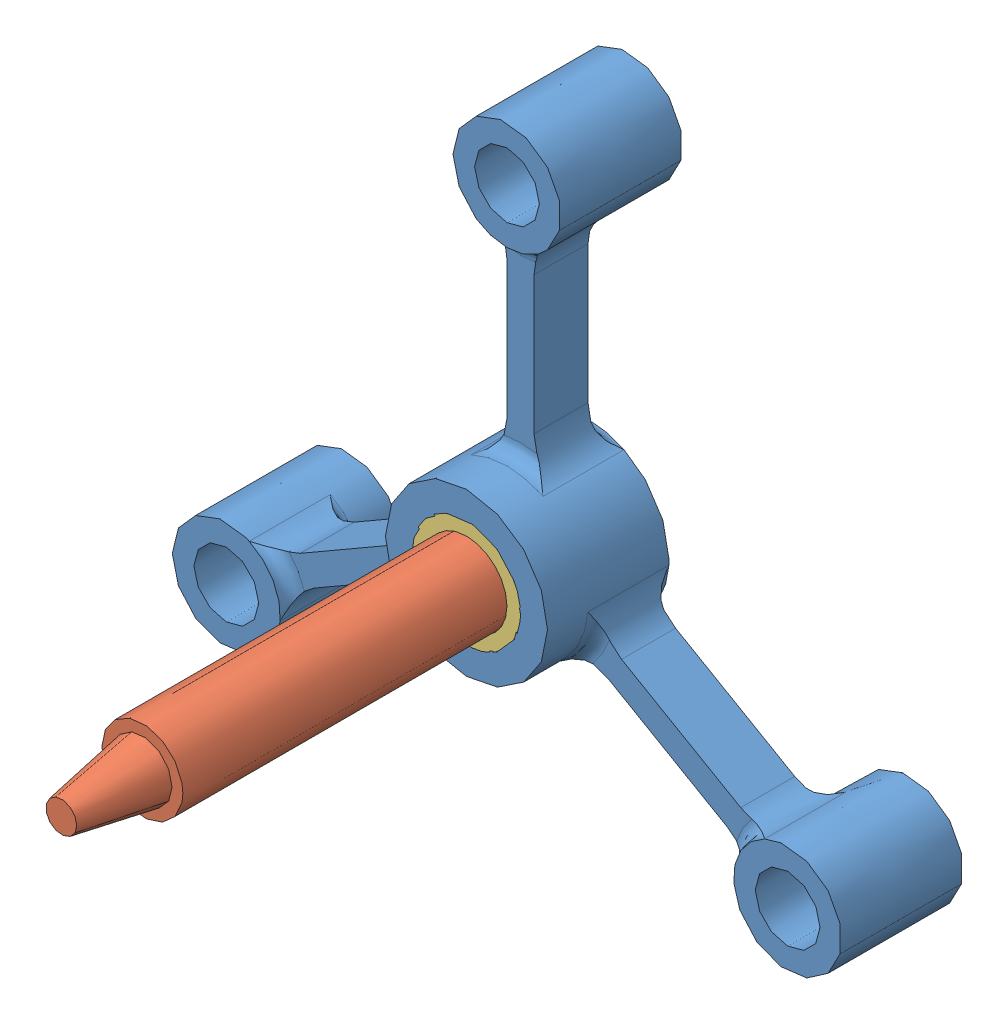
SolidWorks assembly spider.SLDASM, configuration Default (file format 4700). Lengths in mm.
Overall size (157.38 139.7 133.35).
3 component instances, 3 part files, 5 mates.
Components (placement in the parent):
- spider-1: spider.SLDPRT [Default] at (0 0 -28.6004) size (157.38 139.7 38.1)
- shaft-1: shaft.SLDPRT [Default] at (0 0 -28.6004) size (19.05 19.05 120.65)
- hub-1: hub.SLDPRT [Default] at (0 0 -31.7754) size (25.4 25.4 28.57)
Mates (geometry in assembly coordinates):
- Concentric1: concentric anti-aligned: cylinder of spider-1 through (0 0 -41.3004) axis (0 0 1) radius 12.7; cylinder of hub-1 through (0 0 32.7206) axis (0 0 -1) radius 12.7
- Concentric2: concentric anti-aligned: cylinder of shaft-1 through (0 0 72.9996) axis (0 0 -1) radius 9.525; cylinder of hub-1 through (0 0 -31.7754) axis (0 0 1) radius 9.525
- Coincident3: coincident: point of ?
- Coincident5: coincident aligned: plane of spider-1 through (0 0 -31.7754) normal (0 0 -1); plane of hub-1 through (0 0 -31.7754) normal (0 0 -1)
- Distance1: distance = 3.175 mm aligned: plane of spider-1 through (0 0 -31.7754) normal (0 0 -1); plane of shaft-1 through (0 0 -28.6004) normal (0 0 -1)
